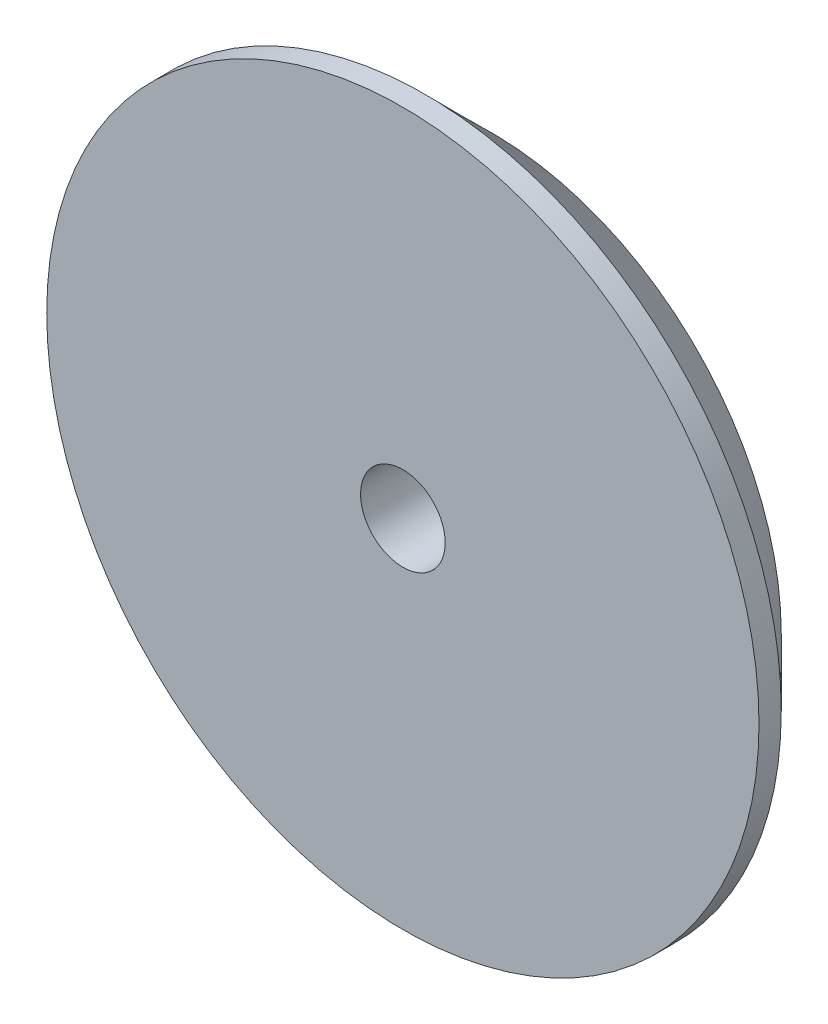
ISO-10303-21;
HEADER;
FILE_DESCRIPTION(('STEP AP214'),'2;1');
FILE_NAME('part.step','',(''),(''),'','','');
FILE_SCHEMA(('AUTOMOTIVE_DESIGN { 1 0 10303 214 1 1 1 1 }'));
ENDSEC;
DATA;
#1=APPLICATION_CONTEXT('core data for automotive mechanical design processes');
#2=APPLICATION_PROTOCOL_DEFINITION('international standard','automotive_design',2000,#1);
#3=PRODUCT_CONTEXT('',#1,'mechanical');
#4=PRODUCT('Part','Part','',(#3));
#5=PRODUCT_RELATED_PRODUCT_CATEGORY('part','',(#4));
#6=PRODUCT_DEFINITION_FORMATION('','',#4);
#7=PRODUCT_DEFINITION_CONTEXT('part definition',#1,'design');
#8=PRODUCT_DEFINITION('design','',#6,#7);
#9=PRODUCT_DEFINITION_SHAPE('','',#8);
#10=(LENGTH_UNIT() NAMED_UNIT(*) SI_UNIT(.MILLI.,.METRE.));
#11=(NAMED_UNIT(*) PLANE_ANGLE_UNIT() SI_UNIT($,.RADIAN.));
#12=(NAMED_UNIT(*) SI_UNIT($,.STERADIAN.) SOLID_ANGLE_UNIT());
#13=UNCERTAINTY_MEASURE_WITH_UNIT(LENGTH_MEASURE(1.E-05),#10,'distance_accuracy_value','');
#14=(GEOMETRIC_REPRESENTATION_CONTEXT(3) GLOBAL_UNCERTAINTY_ASSIGNED_CONTEXT((#13)) GLOBAL_UNIT_ASSIGNED_CONTEXT((#10,
#11,#12)) REPRESENTATION_CONTEXT('',''));
#15=CARTESIAN_POINT('',(0.,0.,0.));
#16=DIRECTION('',(0.,0.,1.));
#17=DIRECTION('',(1.,0.,0.));
#18=AXIS2_PLACEMENT_3D('',#15,#16,#17);
#19=CARTESIAN_POINT('',(0.,0.,2.));
#20=DIRECTION('',(0.,0.,1.));
#21=DIRECTION('',(1.,0.,0.));
#22=AXIS2_PLACEMENT_3D('',#19,#20,#21);
#23=PLANE('',#22);
#24=CARTESIAN_POINT('',(0.,0.,2.));
#25=DIRECTION('',(0.,0.,1.));
#26=DIRECTION('',(1.,0.,0.));
#27=AXIS2_PLACEMENT_3D('',#24,#25,#26);
#28=CIRCLE('',#27,8.);
#29=CARTESIAN_POINT('',(8.00000000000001,0.,2.));
#30=VERTEX_POINT('',#29);
#31=EDGE_CURVE('E25',#30,#30,#28,.T.);
#32=ORIENTED_EDGE('',*,*,#31,.T.);
#33=EDGE_LOOP('',(#32));
#34=FACE_BOUND('',#33,.T.);
#35=CARTESIAN_POINT('',(0.,0.,2.));
#36=DIRECTION('',(0.,0.,1.));
#37=DIRECTION('',(1.,0.,0.));
#38=AXIS2_PLACEMENT_3D('',#35,#36,#37);
#39=CIRCLE('',#38,0.95);
#40=CARTESIAN_POINT('',(0.950000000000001,0.,2.));
#41=VERTEX_POINT('',#40);
#42=EDGE_CURVE('E29',#41,#41,#39,.T.);
#43=ORIENTED_EDGE('',*,*,#42,.F.);
#44=EDGE_LOOP('',(#43));
#45=FACE_BOUND('',#44,.T.);
#46=ADVANCED_FACE('F14',(#34,#45),#23,.T.);
#47=CARTESIAN_POINT('',(0.,0.,0.));
#48=DIRECTION('',(0.,0.,1.));
#49=DIRECTION('',(1.,0.,0.));
#50=AXIS2_PLACEMENT_3D('',#47,#48,#49);
#51=PLANE('',#50);
#52=CARTESIAN_POINT('',(0.,0.,0.));
#53=DIRECTION('',(0.,0.,1.));
#54=DIRECTION('',(1.,0.,0.));
#55=AXIS2_PLACEMENT_3D('',#52,#53,#54);
#56=CIRCLE('',#55,6.5);
#57=CARTESIAN_POINT('',(6.5,0.,0.));
#58=VERTEX_POINT('',#57);
#59=EDGE_CURVE('E10',#58,#58,#56,.F.);
#60=ORIENTED_EDGE('',*,*,#59,.T.);
#61=EDGE_LOOP('',(#60));
#62=FACE_BOUND('',#61,.T.);
#63=CARTESIAN_POINT('',(0.,0.,0.));
#64=DIRECTION('',(0.,0.,1.));
#65=DIRECTION('',(1.,0.,0.));
#66=AXIS2_PLACEMENT_3D('',#63,#64,#65);
#67=CIRCLE('',#66,0.95);
#68=CARTESIAN_POINT('',(0.950000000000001,0.,0.));
#69=VERTEX_POINT('',#68);
#70=EDGE_CURVE('E34',#69,#69,#67,.T.);
#71=ORIENTED_EDGE('',*,*,#70,.T.);
#72=EDGE_LOOP('',(#71));
#73=FACE_BOUND('',#72,.T.);
#74=ADVANCED_FACE('F38',(#62,#73),#51,.F.);
#75=CARTESIAN_POINT('',(0.,0.,2.));
#76=DIRECTION('',(0.,0.,-1.));
#77=DIRECTION('',(-1.,0.,0.));
#78=AXIS2_PLACEMENT_3D('',#75,#76,#77);
#79=CYLINDRICAL_SURFACE('',#78,8.);
#80=CARTESIAN_POINT('',(0.,0.,1.5));
#81=DIRECTION('',(0.,0.,1.));
#82=DIRECTION('',(1.,0.,0.));
#83=AXIS2_PLACEMENT_3D('',#80,#81,#82);
#84=CIRCLE('',#83,8.);
#85=CARTESIAN_POINT('',(8.00000000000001,0.,1.5));
#86=VERTEX_POINT('',#85);
#87=EDGE_CURVE('E21',#86,#86,#84,.T.);
#88=ORIENTED_EDGE('',*,*,#87,.T.);
#89=EDGE_LOOP('',(#88));
#90=FACE_BOUND('',#89,.T.);
#91=ORIENTED_EDGE('',*,*,#31,.F.);
#92=EDGE_LOOP('',(#91));
#93=FACE_BOUND('',#92,.T.);
#94=ADVANCED_FACE('F16',(#90,#93),#79,.T.);
#95=CARTESIAN_POINT('',(0.,0.,2.));
#96=DIRECTION('',(0.,0.,-1.));
#97=DIRECTION('',(-1.,0.,0.));
#98=AXIS2_PLACEMENT_3D('',#95,#96,#97);
#99=CYLINDRICAL_SURFACE('',#98,0.95);
#100=ORIENTED_EDGE('',*,*,#42,.T.);
#101=EDGE_LOOP('',(#100));
#102=FACE_BOUND('',#101,.T.);
#103=ORIENTED_EDGE('',*,*,#70,.F.);
#104=EDGE_LOOP('',(#103));
#105=FACE_BOUND('',#104,.T.);
#106=ADVANCED_FACE('F40',(#102,#105),#99,.F.);
#107=CARTESIAN_POINT('',(0.,0.,1.5));
#108=DIRECTION('',(0.,0.,1.));
#109=DIRECTION('',(1.,0.,0.));
#110=AXIS2_PLACEMENT_3D('',#107,#108,#109);
#111=CONICAL_SURFACE('',#110,8.,0.785398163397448);
#112=ORIENTED_EDGE('',*,*,#59,.F.);
#113=EDGE_LOOP('',(#112));
#114=FACE_BOUND('',#113,.T.);
#115=ORIENTED_EDGE('',*,*,#87,.F.);
#116=EDGE_LOOP('',(#115));
#117=FACE_BOUND('',#116,.T.);
#118=ADVANCED_FACE('F42',(#114,#117),#111,.T.);
#119=CLOSED_SHELL('',(#46,#74,#94,#106,#118));
#120=MANIFOLD_SOLID_BREP('B1',#119);
#121=ADVANCED_BREP_SHAPE_REPRESENTATION('',(#18,#120),#14);
#122=SHAPE_DEFINITION_REPRESENTATION(#9,#121);
ENDSEC;
END-ISO-10303-21;
